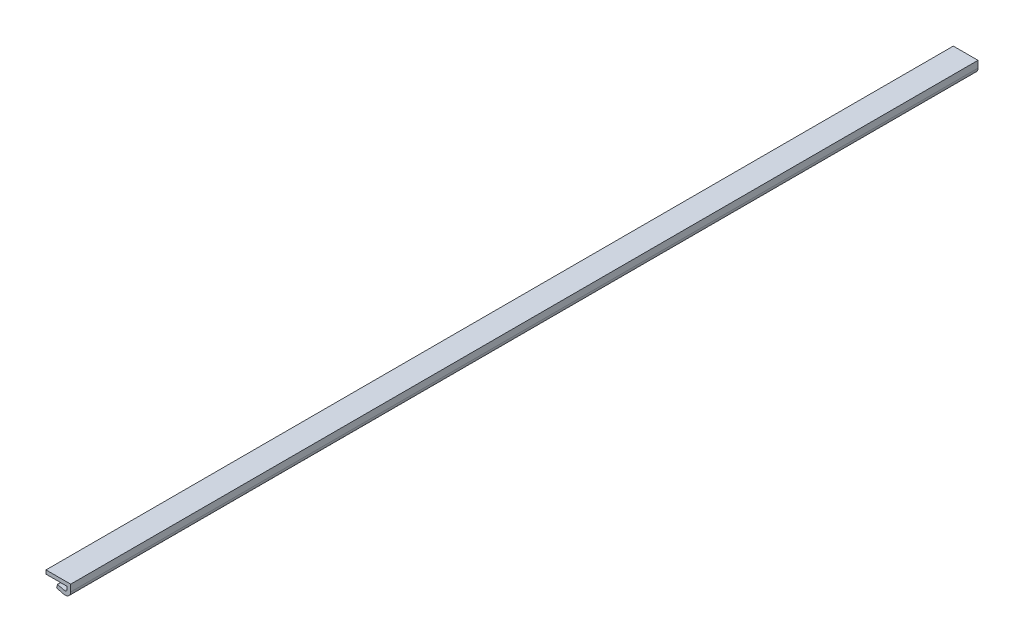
from build123d import *

# Parameters (mm, degrees)
EXTRUSION1_DEPTH = 735


with BuildPart() as part:
    # Esquisse1 → Extrusion1 (new body)
    with BuildSketch(Plane.XY):
        with BuildLine():
            Line((0, 0), (20, 0))
            Line((20, 0), (20, -5.5))
            ThreePointArc((20, -5.5), (18.270476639, -9.046048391), (14.41135147, -9.866330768))
            Line((14.41135147, -9.866330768), (8.573886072, -8.410887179))
            Line((8.573886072, -8.410887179), (9.299651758, -5.5))
            Line((9.299651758, -5.5), (15.137117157, -6.955443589))
            ThreePointArc((15.137117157, -6.955443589), (16.423492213, -6.68201613), (17, -5.5))
            Line((17, -5.5), (17, -3))
            Line((17, -3), (0, -3))
            Line((0, -3), (0, 0))
        make_face()
    extrude(amount=EXTRUSION1_DEPTH)


solid = part.part
